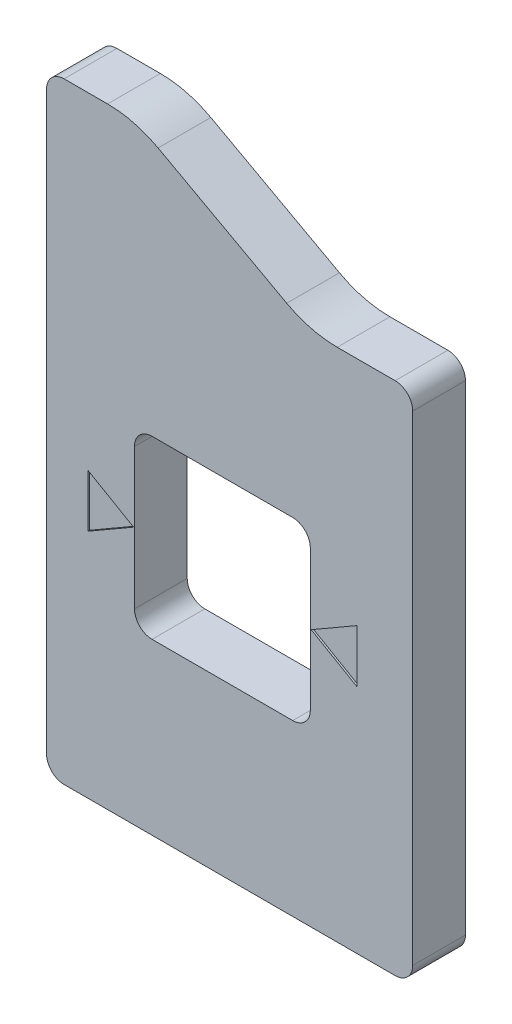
from build123d import *

# Parameters (mm, degrees)
BOSS_EXTRU_1_DEPTH      = 3
ENL_V_MAT_EXTRU_2_DEPTH = 0.1


with BuildPart() as part:
    # Esquisse1 → Boss.-Extru.1 (new body)
    with BuildSketch(Plane.XY.offset(3)):
        with BuildLine():
            Line((15.822446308, -41.665103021), (15.822446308, -14.363539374))
            ThreePointArc((15.822446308, -14.363539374), (15.529553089, -13.656432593), (14.822446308, -13.363539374))
            Line((14.822446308, -13.363539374), (11.529741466, -13.363539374))
            ThreePointArc((11.529741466, -13.363539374), (10.047419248, -13.177550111), (8.656995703, -12.631112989))
            Line((8.656995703, -12.631112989), (1.343004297, -8.642324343))
            ThreePointArc((1.343004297, -8.642324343), (-0.047419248, -8.095887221), (-1.529741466, -7.909897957))
            Line((-1.529741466, -7.909897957), (-4, -7.909897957))
            ThreePointArc((-4, -7.909897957), (-4.707106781, -8.202791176), (-5, -8.909897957))
            Line((-5, -8.909897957), (-5, -41.665103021))
            ThreePointArc((-5, -41.665103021), (-4.707106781, -42.372209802), (-4, -42.665103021))
            Line((-4, -42.665103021), (14.822446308, -42.665103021))
            ThreePointArc((14.822446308, -42.665103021), (15.529553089, -42.372209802), (15.822446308, -41.665103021))
        make_face()
        with BuildLine():
            Line((1, -23.014321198), (9, -23.014321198))
            ThreePointArc((9, -23.014321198), (9.707106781, -23.307214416), (10, -24.014321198))
            Line((10, -24.014321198), (10, -32.014321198))
            ThreePointArc((10, -32.014321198), (9.707106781, -32.721427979), (9, -33.014321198))
            Line((9, -33.014321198), (1, -33.014321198))
            ThreePointArc((1, -33.014321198), (0.292893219, -32.721427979), (0, -32.014321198))
            Line((0, -32.014321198), (0, -24.014321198))
            ThreePointArc((0, -24.014321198), (0.292893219, -23.307214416), (1, -23.014321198))
        make_face(mode=Mode.SUBTRACT)
    extrude(amount=BOSS_EXTRU_1_DEPTH)

    # Esquisse2 → Enl_v. mat.-Extru.2 (cut)
    with BuildSketch(Plane.XY.offset(6)):
        Polygon((-2.648076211, -26.514321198), (-2.648076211, -29.514321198), (-0.05, -28.014321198), align=None)
        Polygon((10.05, -28.014321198), (12.648076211, -26.514321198), (12.648076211, -29.514321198), align=None)
    extrude(amount=-ENL_V_MAT_EXTRU_2_DEPTH, mode=Mode.SUBTRACT)


solid = part.part
